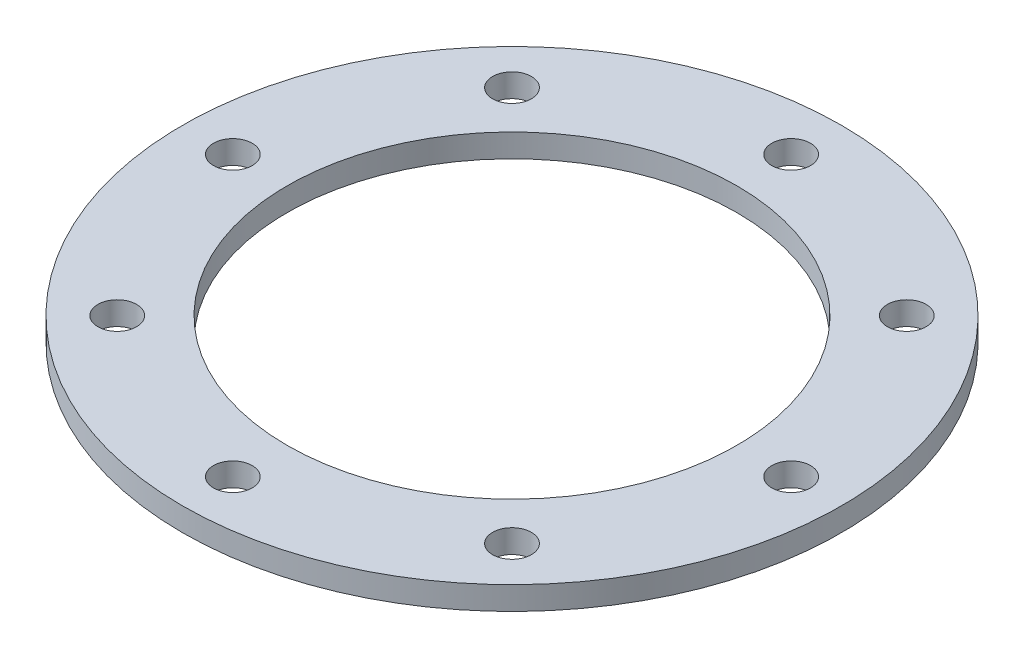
from build123d import *

# Parameters (mm, degrees)
SKETCH1_R           = 42.5
SKETCH1_R_2         = 29
SKETCH1_R_3         = 2.5
BOSS_EXTRUDE1_DEPTH = 3


with BuildPart() as part:
    # Sketch1 → Boss-Extrude1 (new body)
    with BuildSketch(Plane(origin=(0, 0, 0), x_dir=(1, 0, 0), z_dir=(0, 1, 0))):
        with Locations(Location((0, 0, 0), (0, 0, 270))):
            Circle(SKETCH1_R)
        with Locations(Location((0, 0, 0), (0, 0, 270))):
            Circle(SKETCH1_R_2, mode=Mode.SUBTRACT)
        with Locations(Location((36, 0, 0), (0, 0, 270))):
            Circle(SKETCH1_R_3, mode=Mode.SUBTRACT)
        with Locations(Location((25.455844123, -25.455844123, 0), (0, 0, 270))):
            Circle(SKETCH1_R_3, mode=Mode.SUBTRACT)
        with Locations(Location((0, -36, 0), (0, 0, 270))):
            Circle(SKETCH1_R_3, mode=Mode.SUBTRACT)
        with Locations(Location((-25.455844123, -25.455844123, 0), (0, 0, 270))):
            Circle(SKETCH1_R_3, mode=Mode.SUBTRACT)
        with Locations(Location((-36, 0, 0), (0, 0, 270))):
            Circle(SKETCH1_R_3, mode=Mode.SUBTRACT)
        with Locations(Location((-25.455844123, 25.455844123, 0), (0, 0, 270))):
            Circle(SKETCH1_R_3, mode=Mode.SUBTRACT)
        with Locations(Location((0, 36, 0), (0, 0, 270))):
            Circle(SKETCH1_R_3, mode=Mode.SUBTRACT)
        with Locations(Location((25.455844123, 25.455844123, 0), (0, 0, 270))):
            Circle(SKETCH1_R_3, mode=Mode.SUBTRACT)
    extrude(amount=BOSS_EXTRUDE1_DEPTH)


solid = part.part
